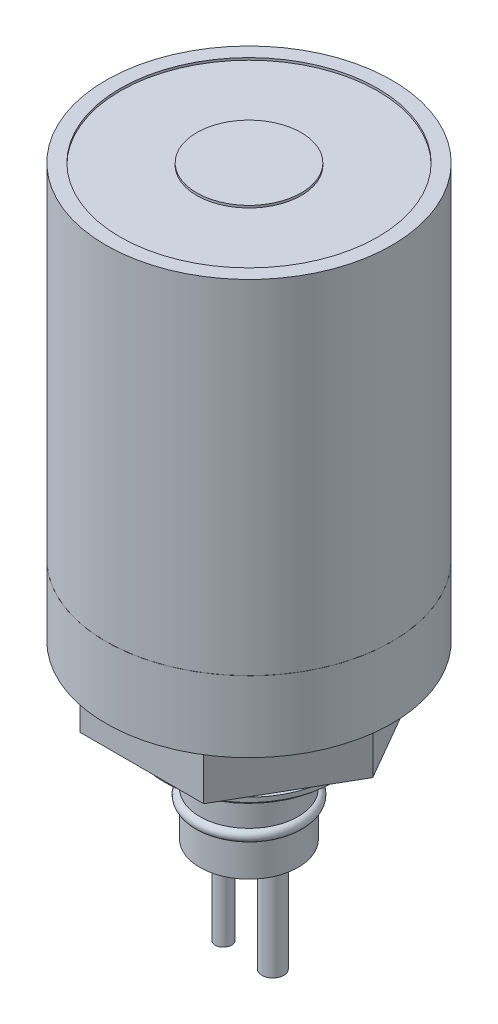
ISO-10303-21;
HEADER;
FILE_DESCRIPTION(('STEP AP214'),'2;1');
FILE_NAME('part.step','',(''),(''),'','','');
FILE_SCHEMA(('AUTOMOTIVE_DESIGN { 1 0 10303 214 1 1 1 1 }'));
ENDSEC;
DATA;
#1=APPLICATION_CONTEXT('core data for automotive mechanical design processes');
#2=APPLICATION_PROTOCOL_DEFINITION('international standard','automotive_design',2000,#1);
#3=PRODUCT_CONTEXT('',#1,'mechanical');
#4=PRODUCT('Part','Part','',(#3));
#5=PRODUCT_RELATED_PRODUCT_CATEGORY('part','',(#4));
#6=PRODUCT_DEFINITION_FORMATION('','',#4);
#7=PRODUCT_DEFINITION_CONTEXT('part definition',#1,'design');
#8=PRODUCT_DEFINITION('design','',#6,#7);
#9=PRODUCT_DEFINITION_SHAPE('','',#8);
#10=(LENGTH_UNIT() NAMED_UNIT(*) SI_UNIT(.MILLI.,.METRE.));
#11=(NAMED_UNIT(*) PLANE_ANGLE_UNIT() SI_UNIT($,.RADIAN.));
#12=(NAMED_UNIT(*) SI_UNIT($,.STERADIAN.) SOLID_ANGLE_UNIT());
#13=UNCERTAINTY_MEASURE_WITH_UNIT(LENGTH_MEASURE(1.E-05),#10,'distance_accuracy_value','');
#14=(GEOMETRIC_REPRESENTATION_CONTEXT(3) GLOBAL_UNCERTAINTY_ASSIGNED_CONTEXT((#13)) GLOBAL_UNIT_ASSIGNED_CONTEXT((#10,
#11,#12)) REPRESENTATION_CONTEXT('',''));
#15=CARTESIAN_POINT('',(0.,0.,0.));
#16=DIRECTION('',(0.,0.,1.));
#17=DIRECTION('',(1.,0.,0.));
#18=AXIS2_PLACEMENT_3D('',#15,#16,#17);
#19=CARTESIAN_POINT('',(5.4536748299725,-65.0367,0.));
#20=DIRECTION('',(0.,1.,0.));
#21=DIRECTION('',(-1.,0.,0.));
#22=AXIS2_PLACEMENT_3D('',#19,#20,#21);
#23=PLANE('',#22);
#24=CARTESIAN_POINT('',(-2.84049327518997,-65.0367,0.));
#25=DIRECTION('',(0.,1.,0.));
#26=DIRECTION('',(-1.,0.,0.));
#27=AXIS2_PLACEMENT_3D('',#24,#25,#26);
#28=CIRCLE('',#27,0.905408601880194);
#29=CARTESIAN_POINT('',(-3.74590187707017,-65.0367,0.));
#30=VERTEX_POINT('',#29);
#31=EDGE_CURVE('E56',#30,#30,#28,.F.);
#32=ORIENTED_EDGE('',*,*,#31,.F.);
#33=EDGE_LOOP('',(#32));
#34=FACE_BOUND('',#33,.T.);
#35=CARTESIAN_POINT('',(0.,-65.0367,0.));
#36=DIRECTION('',(0.,1.,0.));
#37=DIRECTION('',(-1.,0.,0.));
#38=AXIS2_PLACEMENT_3D('',#35,#36,#37);
#39=CIRCLE('',#38,5.45367482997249);
#40=CARTESIAN_POINT('',(-5.45367482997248,-65.0367,0.));
#41=VERTEX_POINT('',#40);
#42=EDGE_CURVE('E137',#41,#41,#39,.T.);
#43=ORIENTED_EDGE('',*,*,#42,.F.);
#44=EDGE_LOOP('',(#43));
#45=FACE_BOUND('',#44,.T.);
#46=CARTESIAN_POINT('',(2.64776545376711,-65.0367,0.));
#47=DIRECTION('',(0.,1.,0.));
#48=DIRECTION('',(-1.,0.,0.));
#49=AXIS2_PLACEMENT_3D('',#46,#47,#48);
#50=CIRCLE('',#49,1.21312683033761);
#51=CARTESIAN_POINT('',(1.4346386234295,-65.0367,0.));
#52=VERTEX_POINT('',#51);
#53=EDGE_CURVE('E12',#52,#52,#50,.F.);
#54=ORIENTED_EDGE('',*,*,#53,.F.);
#55=EDGE_LOOP('',(#54));
#56=FACE_BOUND('',#55,.T.);
#57=ADVANCED_FACE('F48',(#34,#45,#56),#23,.F.);
#58=CARTESIAN_POINT('',(0.,-52.2514068,0.));
#59=DIRECTION('',(0.,-1.,0.));
#60=DIRECTION('',(0.,0.,-1.));
#61=AXIS2_PLACEMENT_3D('',#58,#59,#60);
#62=PLANE('',#61);
#63=DIRECTION('',(0.5,0.,0.866025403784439));
#64=VECTOR('',#63,1.);
#65=CARTESIAN_POINT('',(6.87041046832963,-52.2514068,-11.8999));
#66=LINE('',#65,#64);
#67=CARTESIAN_POINT('',(6.87041046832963,-52.2514068,-11.8999));
#68=VERTEX_POINT('',#67);
#69=CARTESIAN_POINT('',(13.7408209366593,-52.2514068,0.));
#70=VERTEX_POINT('',#69);
#71=EDGE_CURVE('E145',#68,#70,#66,.T.);
#72=ORIENTED_EDGE('',*,*,#71,.T.);
#73=DIRECTION('',(-0.5,0.,0.866025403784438));
#74=VECTOR('',#73,1.);
#75=CARTESIAN_POINT('',(13.7408209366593,-52.2514068,0.));
#76=LINE('',#75,#74);
#77=CARTESIAN_POINT('',(6.87041046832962,-52.2514068,11.8999));
#78=VERTEX_POINT('',#77);
#79=EDGE_CURVE('E99',#70,#78,#76,.T.);
#80=ORIENTED_EDGE('',*,*,#79,.T.);
#81=DIRECTION('',(-1.,0.,0.));
#82=VECTOR('',#81,1.);
#83=CARTESIAN_POINT('',(6.87041046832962,-52.2514068,11.8999));
#84=LINE('',#83,#82);
#85=CARTESIAN_POINT('',(-6.87041046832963,-52.2514068,11.8999));
#86=VERTEX_POINT('',#85);
#87=EDGE_CURVE('E113',#78,#86,#84,.T.);
#88=ORIENTED_EDGE('',*,*,#87,.T.);
#89=DIRECTION('',(-0.5,0.,-0.866025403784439));
#90=VECTOR('',#89,1.);
#91=CARTESIAN_POINT('',(-6.87041046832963,-52.2514068,11.8999));
#92=LINE('',#91,#90);
#93=CARTESIAN_POINT('',(-13.7408209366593,-52.2514068,0.));
#94=VERTEX_POINT('',#93);
#95=EDGE_CURVE('E106',#86,#94,#92,.T.);
#96=ORIENTED_EDGE('',*,*,#95,.T.);
#97=DIRECTION('',(0.5,0.,-0.866025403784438));
#98=VECTOR('',#97,1.);
#99=CARTESIAN_POINT('',(-13.7408209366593,-52.2514068,0.));
#100=LINE('',#99,#98);
#101=CARTESIAN_POINT('',(-6.87041046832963,-52.2514068,-11.8999));
#102=VERTEX_POINT('',#101);
#103=EDGE_CURVE('E111',#94,#102,#100,.T.);
#104=ORIENTED_EDGE('',*,*,#103,.T.);
#105=DIRECTION('',(1.,0.,0.));
#106=VECTOR('',#105,1.);
#107=CARTESIAN_POINT('',(-6.87041046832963,-52.2514068,-11.8999));
#108=LINE('',#107,#106);
#109=EDGE_CURVE('E71',#102,#68,#108,.T.);
#110=ORIENTED_EDGE('',*,*,#109,.T.);
#111=EDGE_LOOP('',(#72,#80,#88,#96,#104,#110));
#112=FACE_BOUND('',#111,.T.);
#113=CARTESIAN_POINT('',(0.,-52.2514068,0.));
#114=DIRECTION('',(0.,1.,0.));
#115=DIRECTION('',(-1.,0.,0.));
#116=AXIS2_PLACEMENT_3D('',#113,#114,#115);
#117=CIRCLE('',#116,8.801);
#118=CARTESIAN_POINT('',(-8.80099999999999,-52.2514068,0.));
#119=VERTEX_POINT('',#118);
#120=EDGE_CURVE('E385',#119,#119,#117,.T.);
#121=ORIENTED_EDGE('',*,*,#120,.T.);
#122=EDGE_LOOP('',(#121));
#123=FACE_BOUND('',#122,.T.);
#124=ADVANCED_FACE('F108',(#112,#123),#62,.T.);
#125=CARTESIAN_POINT('',(0.,-45.9867,0.));
#126=DIRECTION('',(0.,-1.,0.));
#127=DIRECTION('',(0.,0.,-1.));
#128=AXIS2_PLACEMENT_3D('',#125,#126,#127);
#129=PLANE('',#128);
#130=CARTESIAN_POINT('',(0.,-45.9867,0.));
#131=DIRECTION('',(0.,-1.,0.));
#132=DIRECTION('',(0.,0.,-1.));
#133=AXIS2_PLACEMENT_3D('',#130,#131,#132);
#134=CIRCLE('',#133,15.875);
#135=CARTESIAN_POINT('',(0.,-45.9867,-15.875));
#136=VERTEX_POINT('',#135);
#137=EDGE_CURVE('E175',#136,#136,#134,.T.);
#138=ORIENTED_EDGE('',*,*,#137,.T.);
#139=EDGE_LOOP('',(#138));
#140=FACE_BOUND('',#139,.T.);
#141=CARTESIAN_POINT('',(11.6859302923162,-45.9867,-6.74687500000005));
#142=DIRECTION('',(0.,-1.,0.));
#143=DIRECTION('',(0.,0.,-1.));
#144=AXIS2_PLACEMENT_3D('',#141,#142,#143);
#145=CIRCLE('',#144,1.35255);
#146=CARTESIAN_POINT('',(11.6859302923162,-45.9867,-8.09942500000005));
#147=VERTEX_POINT('',#146);
#148=EDGE_CURVE('E168',#147,#147,#145,.T.);
#149=ORIENTED_EDGE('',*,*,#148,.F.);
#150=EDGE_LOOP('',(#149));
#151=FACE_BOUND('',#150,.T.);
#152=CARTESIAN_POINT('',(-11.6859302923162,-45.9867,-6.74687500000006));
#153=DIRECTION('',(0.,-1.,0.));
#154=DIRECTION('',(0.,0.,-1.));
#155=AXIS2_PLACEMENT_3D('',#152,#153,#154);
#156=CIRCLE('',#155,1.35255);
#157=CARTESIAN_POINT('',(-11.6859302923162,-45.9867,-8.09942500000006));
#158=VERTEX_POINT('',#157);
#159=EDGE_CURVE('E164',#158,#158,#156,.T.);
#160=ORIENTED_EDGE('',*,*,#159,.F.);
#161=EDGE_LOOP('',(#160));
#162=FACE_BOUND('',#161,.T.);
#163=CARTESIAN_POINT('',(0.,-45.9867,13.49375));
#164=DIRECTION('',(0.,-1.,0.));
#165=DIRECTION('',(0.,0.,-1.));
#166=AXIS2_PLACEMENT_3D('',#163,#164,#165);
#167=CIRCLE('',#166,1.35255);
#168=CARTESIAN_POINT('',(0.,-45.9867,12.1412));
#169=VERTEX_POINT('',#168);
#170=EDGE_CURVE('E160',#169,#169,#167,.T.);
#171=ORIENTED_EDGE('',*,*,#170,.F.);
#172=EDGE_LOOP('',(#171));
#173=FACE_BOUND('',#172,.T.);
#174=DIRECTION('',(-0.5,0.,0.866025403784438));
#175=VECTOR('',#174,1.);
#176=CARTESIAN_POINT('',(13.7408209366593,-45.9867,0.));
#177=LINE('',#176,#175);
#178=CARTESIAN_POINT('',(13.7408209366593,-45.9867,0.));
#179=VERTEX_POINT('',#178);
#180=CARTESIAN_POINT('',(6.87041046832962,-45.9867,11.8999));
#181=VERTEX_POINT('',#180);
#182=EDGE_CURVE('E136',#179,#181,#177,.T.);
#183=ORIENTED_EDGE('',*,*,#182,.F.);
#184=DIRECTION('',(0.5,0.,0.866025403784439));
#185=VECTOR('',#184,1.);
#186=CARTESIAN_POINT('',(6.87041046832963,-45.9867,-11.8999));
#187=LINE('',#186,#185);
#188=CARTESIAN_POINT('',(6.87041046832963,-45.9867,-11.8999));
#189=VERTEX_POINT('',#188);
#190=EDGE_CURVE('E133',#189,#179,#187,.T.);
#191=ORIENTED_EDGE('',*,*,#190,.F.);
#192=DIRECTION('',(1.,0.,0.));
#193=VECTOR('',#192,1.);
#194=CARTESIAN_POINT('',(-6.87041046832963,-45.9867,-11.8999));
#195=LINE('',#194,#193);
#196=CARTESIAN_POINT('',(-6.87041046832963,-45.9867,-11.8999));
#197=VERTEX_POINT('',#196);
#198=EDGE_CURVE('E91',#197,#189,#195,.T.);
#199=ORIENTED_EDGE('',*,*,#198,.F.);
#200=DIRECTION('',(0.5,0.,-0.866025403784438));
#201=VECTOR('',#200,1.);
#202=CARTESIAN_POINT('',(-13.7408209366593,-45.9867,0.));
#203=LINE('',#202,#201);
#204=CARTESIAN_POINT('',(-13.7408209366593,-45.9867,0.));
#205=VERTEX_POINT('',#204);
#206=EDGE_CURVE('E142',#205,#197,#203,.T.);
#207=ORIENTED_EDGE('',*,*,#206,.F.);
#208=DIRECTION('',(-0.5,0.,-0.866025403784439));
#209=VECTOR('',#208,1.);
#210=CARTESIAN_POINT('',(-6.87041046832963,-45.9867,11.8999));
#211=LINE('',#210,#209);
#212=CARTESIAN_POINT('',(-6.87041046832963,-45.9867,11.8999));
#213=VERTEX_POINT('',#212);
#214=EDGE_CURVE('E122',#213,#205,#211,.T.);
#215=ORIENTED_EDGE('',*,*,#214,.F.);
#216=DIRECTION('',(-1.,0.,0.));
#217=VECTOR('',#216,1.);
#218=CARTESIAN_POINT('',(6.87041046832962,-45.9867,11.8999));
#219=LINE('',#218,#217);
#220=EDGE_CURVE('E139',#181,#213,#219,.T.);
#221=ORIENTED_EDGE('',*,*,#220,.F.);
#222=EDGE_LOOP('',(#183,#191,#199,#207,#215,#221));
#223=FACE_BOUND('',#222,.T.);
#224=ADVANCED_FACE('F270',(#140,#151,#162,#173,#223),#129,.T.);
#225=CARTESIAN_POINT('',(0.,-45.9867,0.));
#226=DIRECTION('',(0.,1.,0.));
#227=DIRECTION('',(0.,0.,1.));
#228=AXIS2_PLACEMENT_3D('',#225,#226,#227);
#229=CYLINDRICAL_SURFACE('',#228,15.875);
#230=ORIENTED_EDGE('',*,*,#137,.F.);
#231=EDGE_LOOP('',(#230));
#232=FACE_BOUND('',#231,.T.);
#233=CARTESIAN_POINT('',(0.,-38.1127,0.));
#234=DIRECTION('',(0.,-1.,0.));
#235=DIRECTION('',(0.,0.,-1.));
#236=AXIS2_PLACEMENT_3D('',#233,#234,#235);
#237=CIRCLE('',#236,15.875);
#238=CARTESIAN_POINT('',(0.,-38.1127,-15.875));
#239=VERTEX_POINT('',#238);
#240=EDGE_CURVE('E174',#239,#239,#237,.T.);
#241=ORIENTED_EDGE('',*,*,#240,.T.);
#242=EDGE_LOOP('',(#241));
#243=FACE_BOUND('',#242,.T.);
#244=ADVANCED_FACE('F50',(#232,#243),#229,.T.);
#245=CARTESIAN_POINT('',(0.,-38.1127,0.));
#246=DIRECTION('',(0.,-1.,0.));
#247=DIRECTION('',(0.,0.,-1.));
#248=AXIS2_PLACEMENT_3D('',#245,#246,#247);
#249=PLANE('',#248);
#250=CARTESIAN_POINT('',(-0.140879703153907,-38.1127,0.0854933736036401));
#251=DIRECTION('',(0.,-1.,0.));
#252=DIRECTION('',(0.,0.,-1.));
#253=AXIS2_PLACEMENT_3D('',#250,#251,#252);
#254=CIRCLE('',#253,4.96062);
#255=CARTESIAN_POINT('',(-0.140879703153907,-38.1127,-4.87512662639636));
#256=VERTEX_POINT('',#255);
#257=EDGE_CURVE('E157',#256,#256,#254,.T.);
#258=ORIENTED_EDGE('',*,*,#257,.T.);
#259=EDGE_LOOP('',(#258));
#260=FACE_BOUND('',#259,.T.);
#261=CARTESIAN_POINT('',(0.,-38.1127,13.49375));
#262=DIRECTION('',(0.,-1.,0.));
#263=DIRECTION('',(0.,0.,-1.));
#264=AXIS2_PLACEMENT_3D('',#261,#262,#263);
#265=CIRCLE('',#264,1.35255);
#266=CARTESIAN_POINT('',(0.,-38.1127,12.1412));
#267=VERTEX_POINT('',#266);
#268=EDGE_CURVE('E163',#267,#267,#265,.T.);
#269=ORIENTED_EDGE('',*,*,#268,.T.);
#270=EDGE_LOOP('',(#269));
#271=FACE_BOUND('',#270,.T.);
#272=CARTESIAN_POINT('',(-11.6859302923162,-38.1127,-6.74687500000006));
#273=DIRECTION('',(0.,-1.,0.));
#274=DIRECTION('',(0.,0.,-1.));
#275=AXIS2_PLACEMENT_3D('',#272,#273,#274);
#276=CIRCLE('',#275,1.35255);
#277=CARTESIAN_POINT('',(-11.6859302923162,-38.1127,-8.09942500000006));
#278=VERTEX_POINT('',#277);
#279=EDGE_CURVE('E167',#278,#278,#276,.T.);
#280=ORIENTED_EDGE('',*,*,#279,.T.);
#281=EDGE_LOOP('',(#280));
#282=FACE_BOUND('',#281,.T.);
#283=CARTESIAN_POINT('',(11.6859302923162,-38.1127,-6.74687500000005));
#284=DIRECTION('',(0.,-1.,0.));
#285=DIRECTION('',(0.,0.,-1.));
#286=AXIS2_PLACEMENT_3D('',#283,#284,#285);
#287=CIRCLE('',#286,1.35255);
#288=CARTESIAN_POINT('',(11.6859302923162,-38.1127,-8.09942500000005));
#289=VERTEX_POINT('',#288);
#290=EDGE_CURVE('E171',#289,#289,#287,.T.);
#291=ORIENTED_EDGE('',*,*,#290,.T.);
#292=EDGE_LOOP('',(#291));
#293=FACE_BOUND('',#292,.T.);
#294=ORIENTED_EDGE('',*,*,#240,.F.);
#295=EDGE_LOOP('',(#294));
#296=FACE_BOUND('',#295,.T.);
#297=ADVANCED_FACE('F307',(#260,#271,#282,#293,#296),#249,.F.);
#298=CARTESIAN_POINT('',(11.6859302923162,-45.9867,-6.74687500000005));
#299=DIRECTION('',(0.,-1.,0.));
#300=DIRECTION('',(0.,0.,-1.));
#301=AXIS2_PLACEMENT_3D('',#298,#299,#300);
#302=CYLINDRICAL_SURFACE('',#301,1.35255);
#303=ORIENTED_EDGE('',*,*,#148,.T.);
#304=EDGE_LOOP('',(#303));
#305=FACE_BOUND('',#304,.T.);
#306=ORIENTED_EDGE('',*,*,#290,.F.);
#307=EDGE_LOOP('',(#306));
#308=FACE_BOUND('',#307,.T.);
#309=ADVANCED_FACE('F303',(#305,#308),#302,.F.);
#310=CARTESIAN_POINT('',(-11.6859302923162,-45.9867,-6.74687500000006));
#311=DIRECTION('',(0.,-1.,0.));
#312=DIRECTION('',(0.,0.,-1.));
#313=AXIS2_PLACEMENT_3D('',#310,#311,#312);
#314=CYLINDRICAL_SURFACE('',#313,1.35255);
#315=ORIENTED_EDGE('',*,*,#159,.T.);
#316=EDGE_LOOP('',(#315));
#317=FACE_BOUND('',#316,.T.);
#318=ORIENTED_EDGE('',*,*,#279,.F.);
#319=EDGE_LOOP('',(#318));
#320=FACE_BOUND('',#319,.T.);
#321=ADVANCED_FACE('F299',(#317,#320),#314,.F.);
#322=CARTESIAN_POINT('',(0.,-45.9867,13.49375));
#323=DIRECTION('',(0.,-1.,0.));
#324=DIRECTION('',(0.,0.,-1.));
#325=AXIS2_PLACEMENT_3D('',#322,#323,#324);
#326=CYLINDRICAL_SURFACE('',#325,1.35255);
#327=ORIENTED_EDGE('',*,*,#170,.T.);
#328=EDGE_LOOP('',(#327));
#329=FACE_BOUND('',#328,.T.);
#330=ORIENTED_EDGE('',*,*,#268,.F.);
#331=EDGE_LOOP('',(#330));
#332=FACE_BOUND('',#331,.T.);
#333=ADVANCED_FACE('F295',(#329,#332),#326,.F.);
#334=CARTESIAN_POINT('',(-0.140879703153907,-45.9867,0.0854933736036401));
#335=DIRECTION('',(0.,-1.,0.));
#336=DIRECTION('',(0.,0.,-1.));
#337=AXIS2_PLACEMENT_3D('',#334,#335,#336);
#338=CYLINDRICAL_SURFACE('',#337,4.96062);
#339=CARTESIAN_POINT('',(-0.140879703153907,-45.9867,0.0854933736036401));
#340=DIRECTION('',(0.,-1.,0.));
#341=DIRECTION('',(0.,0.,-1.));
#342=AXIS2_PLACEMENT_3D('',#339,#340,#341);
#343=CIRCLE('',#342,4.96062);
#344=CARTESIAN_POINT('',(-0.140879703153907,-45.9867,-4.87512662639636));
#345=VERTEX_POINT('',#344);
#346=EDGE_CURVE('E154',#345,#345,#343,.F.);
#347=ORIENTED_EDGE('',*,*,#346,.F.);
#348=EDGE_LOOP('',(#347));
#349=FACE_BOUND('',#348,.T.);
#350=ORIENTED_EDGE('',*,*,#257,.F.);
#351=EDGE_LOOP('',(#350));
#352=FACE_BOUND('',#351,.T.);
#353=ADVANCED_FACE('F275',(#349,#352),#338,.F.);
#354=CARTESIAN_POINT('',(0.,-45.9867,0.));
#355=DIRECTION('',(0.,-1.,0.));
#356=DIRECTION('',(0.,0.,-1.));
#357=AXIS2_PLACEMENT_3D('',#354,#355,#356);
#358=PLANE('',#357);
#359=ORIENTED_EDGE('',*,*,#346,.T.);
#360=EDGE_LOOP('',(#359));
#361=FACE_BOUND('',#360,.T.);
#362=ADVANCED_FACE('F271',(#361),#358,.F.);
#363=CARTESIAN_POINT('',(6.87041046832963,-52.2514068,-11.8999));
#364=DIRECTION('',(-0.866025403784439,0.,0.5));
#365=DIRECTION('',(0.5,0.,0.866025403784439));
#366=AXIS2_PLACEMENT_3D('',#363,#364,#365);
#367=PLANE('',#366);
#368=ORIENTED_EDGE('',*,*,#190,.T.);
#369=DIRECTION('',(0.,1.,0.));
#370=VECTOR('',#369,1.);
#371=CARTESIAN_POINT('',(13.7408209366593,-52.2514068,0.));
#372=LINE('',#371,#370);
#373=EDGE_CURVE('E152',#70,#179,#372,.T.);
#374=ORIENTED_EDGE('',*,*,#373,.F.);
#375=ORIENTED_EDGE('',*,*,#71,.F.);
#376=DIRECTION('',(0.,1.,0.));
#377=VECTOR('',#376,1.);
#378=CARTESIAN_POINT('',(6.87041046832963,-52.2514068,-11.8999));
#379=LINE('',#378,#377);
#380=EDGE_CURVE('E129',#68,#189,#379,.T.);
#381=ORIENTED_EDGE('',*,*,#380,.T.);
#382=EDGE_LOOP('',(#368,#374,#375,#381));
#383=FACE_BOUND('',#382,.T.);
#384=ADVANCED_FACE('F274',(#383),#367,.F.);
#385=CARTESIAN_POINT('',(13.7408209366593,-52.2514068,0.));
#386=DIRECTION('',(-0.866025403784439,0.,-0.5));
#387=DIRECTION('',(-0.5,0.,0.866025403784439));
#388=AXIS2_PLACEMENT_3D('',#385,#386,#387);
#389=PLANE('',#388);
#390=ORIENTED_EDGE('',*,*,#182,.T.);
#391=DIRECTION('',(0.,1.,0.));
#392=VECTOR('',#391,1.);
#393=CARTESIAN_POINT('',(6.87041046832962,-52.2514068,11.8999));
#394=LINE('',#393,#392);
#395=EDGE_CURVE('E149',#78,#181,#394,.T.);
#396=ORIENTED_EDGE('',*,*,#395,.F.);
#397=ORIENTED_EDGE('',*,*,#79,.F.);
#398=ORIENTED_EDGE('',*,*,#373,.T.);
#399=EDGE_LOOP('',(#390,#396,#397,#398));
#400=FACE_BOUND('',#399,.T.);
#401=ADVANCED_FACE('F286',(#400),#389,.F.);
#402=CARTESIAN_POINT('',(6.87041046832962,-52.2514068,11.8999));
#403=DIRECTION('',(0.,0.,-1.));
#404=DIRECTION('',(-1.,0.,0.));
#405=AXIS2_PLACEMENT_3D('',#402,#403,#404);
#406=PLANE('',#405);
#407=ORIENTED_EDGE('',*,*,#220,.T.);
#408=DIRECTION('',(0.,1.,0.));
#409=VECTOR('',#408,1.);
#410=CARTESIAN_POINT('',(-6.87041046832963,-52.2514068,11.8999));
#411=LINE('',#410,#409);
#412=EDGE_CURVE('E125',#86,#213,#411,.T.);
#413=ORIENTED_EDGE('',*,*,#412,.F.);
#414=ORIENTED_EDGE('',*,*,#87,.F.);
#415=ORIENTED_EDGE('',*,*,#395,.T.);
#416=EDGE_LOOP('',(#407,#413,#414,#415));
#417=FACE_BOUND('',#416,.T.);
#418=ADVANCED_FACE('F283',(#417),#406,.F.);
#419=CARTESIAN_POINT('',(-6.87041046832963,-52.2514068,11.8999));
#420=DIRECTION('',(0.866025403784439,0.,-0.5));
#421=DIRECTION('',(-0.5,0.,-0.866025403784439));
#422=AXIS2_PLACEMENT_3D('',#419,#420,#421);
#423=PLANE('',#422);
#424=ORIENTED_EDGE('',*,*,#214,.T.);
#425=DIRECTION('',(0.,1.,0.));
#426=VECTOR('',#425,1.);
#427=CARTESIAN_POINT('',(-13.7408209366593,-52.2514068,0.));
#428=LINE('',#427,#426);
#429=EDGE_CURVE('E119',#94,#205,#428,.T.);
#430=ORIENTED_EDGE('',*,*,#429,.F.);
#431=ORIENTED_EDGE('',*,*,#95,.F.);
#432=ORIENTED_EDGE('',*,*,#412,.T.);
#433=EDGE_LOOP('',(#424,#430,#431,#432));
#434=FACE_BOUND('',#433,.T.);
#435=ADVANCED_FACE('F120',(#434),#423,.F.);
#436=CARTESIAN_POINT('',(-13.7408209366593,-52.2514068,0.));
#437=DIRECTION('',(0.866025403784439,0.,0.5));
#438=DIRECTION('',(0.5,0.,-0.866025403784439));
#439=AXIS2_PLACEMENT_3D('',#436,#437,#438);
#440=PLANE('',#439);
#441=ORIENTED_EDGE('',*,*,#206,.T.);
#442=DIRECTION('',(0.,1.,0.));
#443=VECTOR('',#442,1.);
#444=CARTESIAN_POINT('',(-6.87041046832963,-52.2514068,-11.8999));
#445=LINE('',#444,#443);
#446=EDGE_CURVE('E63',#102,#197,#445,.T.);
#447=ORIENTED_EDGE('',*,*,#446,.F.);
#448=ORIENTED_EDGE('',*,*,#103,.F.);
#449=ORIENTED_EDGE('',*,*,#429,.T.);
#450=EDGE_LOOP('',(#441,#447,#448,#449));
#451=FACE_BOUND('',#450,.T.);
#452=ADVANCED_FACE('F127',(#451),#440,.F.);
#453=CARTESIAN_POINT('',(-6.87041046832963,-52.2514068,-11.8999));
#454=DIRECTION('',(0.,0.,1.));
#455=DIRECTION('',(1.,0.,0.));
#456=AXIS2_PLACEMENT_3D('',#453,#454,#455);
#457=PLANE('',#456);
#458=ORIENTED_EDGE('',*,*,#198,.T.);
#459=ORIENTED_EDGE('',*,*,#380,.F.);
#460=ORIENTED_EDGE('',*,*,#109,.F.);
#461=ORIENTED_EDGE('',*,*,#446,.T.);
#462=EDGE_LOOP('',(#458,#459,#460,#461));
#463=FACE_BOUND('',#462,.T.);
#464=ADVANCED_FACE('F265',(#463),#457,.F.);
#465=CARTESIAN_POINT('',(0.,0.,0.));
#466=DIRECTION('',(0.,1.,0.));
#467=DIRECTION('',(-1.,0.,0.));
#468=AXIS2_PLACEMENT_3D('',#465,#466,#467);
#469=CYLINDRICAL_SURFACE('',#468,5.45367482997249);
#470=CARTESIAN_POINT('',(0.,-61.3286105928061,0.));
#471=DIRECTION('',(0.,1.,0.));
#472=DIRECTION('',(-1.,0.,0.));
#473=AXIS2_PLACEMENT_3D('',#470,#471,#472);
#474=CIRCLE('',#473,5.45367482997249);
#475=CARTESIAN_POINT('',(-5.45367482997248,-61.3286105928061,0.));
#476=VERTEX_POINT('',#475);
#477=EDGE_CURVE('E349',#476,#476,#474,.T.);
#478=ORIENTED_EDGE('',*,*,#477,.F.);
#479=EDGE_LOOP('',(#478));
#480=FACE_BOUND('',#479,.T.);
#481=ORIENTED_EDGE('',*,*,#42,.T.);
#482=EDGE_LOOP('',(#481));
#483=FACE_BOUND('',#482,.T.);
#484=ADVANCED_FACE('F262',(#480,#483),#469,.T.);
#485=CARTESIAN_POINT('',(0.,-60.7396378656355,0.));
#486=DIRECTION('',(0.,1.,0.));
#487=DIRECTION('',(-1.,0.,0.));
#488=AXIS2_PLACEMENT_3D('',#485,#486,#487);
#489=TOROIDAL_SURFACE('',#488,5.45367482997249,0.588972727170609);
#490=CARTESIAN_POINT('',(0.,-60.1506651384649,0.));
#491=DIRECTION('',(0.,1.,0.));
#492=DIRECTION('',(-1.,0.,0.));
#493=AXIS2_PLACEMENT_3D('',#490,#491,#492);
#494=CIRCLE('',#493,5.45367482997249);
#495=CARTESIAN_POINT('',(-5.45367482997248,-60.1506651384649,0.));
#496=VERTEX_POINT('',#495);
#497=EDGE_CURVE('E352',#496,#496,#494,.T.);
#498=ORIENTED_EDGE('',*,*,#497,.F.);
#499=EDGE_LOOP('',(#498));
#500=FACE_BOUND('',#499,.T.);
#501=ORIENTED_EDGE('',*,*,#477,.T.);
#502=EDGE_LOOP('',(#501));
#503=FACE_BOUND('',#502,.T.);
#504=ADVANCED_FACE('F258',(#500,#503),#489,.T.);
#505=CARTESIAN_POINT('',(0.,0.,0.));
#506=DIRECTION('',(0.,1.,0.));
#507=DIRECTION('',(-1.,0.,0.));
#508=AXIS2_PLACEMENT_3D('',#505,#506,#507);
#509=CYLINDRICAL_SURFACE('',#508,5.45367482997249);
#510=CARTESIAN_POINT('',(0.,-55.3809408,0.));
#511=DIRECTION('',(0.,1.,0.));
#512=DIRECTION('',(-1.,0.,0.));
#513=AXIS2_PLACEMENT_3D('',#510,#511,#512);
#514=CIRCLE('',#513,5.45367482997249);
#515=CARTESIAN_POINT('',(-5.45367482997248,-55.3809408,0.));
#516=VERTEX_POINT('',#515);
#517=EDGE_CURVE('E355',#516,#516,#514,.T.);
#518=ORIENTED_EDGE('',*,*,#517,.F.);
#519=EDGE_LOOP('',(#518));
#520=FACE_BOUND('',#519,.T.);
#521=ORIENTED_EDGE('',*,*,#497,.T.);
#522=EDGE_LOOP('',(#521));
#523=FACE_BOUND('',#522,.T.);
#524=ADVANCED_FACE('F254',(#520,#523),#509,.T.);
#525=CARTESIAN_POINT('',(8.80100000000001,-55.3809408,0.));
#526=DIRECTION('',(0.,1.,0.));
#527=DIRECTION('',(-1.,0.,0.));
#528=AXIS2_PLACEMENT_3D('',#525,#526,#527);
#529=PLANE('',#528);
#530=CARTESIAN_POINT('',(0.,-55.3809408,0.));
#531=DIRECTION('',(0.,1.,0.));
#532=DIRECTION('',(-1.,0.,0.));
#533=AXIS2_PLACEMENT_3D('',#530,#531,#532);
#534=CIRCLE('',#533,8.801);
#535=CARTESIAN_POINT('',(-8.80099999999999,-55.3809408,0.));
#536=VERTEX_POINT('',#535);
#537=EDGE_CURVE('E358',#536,#536,#534,.T.);
#538=ORIENTED_EDGE('',*,*,#537,.F.);
#539=EDGE_LOOP('',(#538));
#540=FACE_BOUND('',#539,.T.);
#541=ORIENTED_EDGE('',*,*,#517,.T.);
#542=EDGE_LOOP('',(#541));
#543=FACE_BOUND('',#542,.T.);
#544=ADVANCED_FACE('F250',(#540,#543),#529,.F.);
#545=CARTESIAN_POINT('',(0.,0.,0.));
#546=DIRECTION('',(0.,1.,0.));
#547=DIRECTION('',(-1.,0.,0.));
#548=AXIS2_PLACEMENT_3D('',#545,#546,#547);
#549=CYLINDRICAL_SURFACE('',#548,8.801);
#550=CARTESIAN_POINT('',(0.,-54.8729408,0.));
#551=DIRECTION('',(0.,1.,0.));
#552=DIRECTION('',(-1.,0.,0.));
#553=AXIS2_PLACEMENT_3D('',#550,#551,#552);
#554=CIRCLE('',#553,8.801);
#555=CARTESIAN_POINT('',(-8.80099999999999,-54.8729408,0.));
#556=VERTEX_POINT('',#555);
#557=EDGE_CURVE('E361',#556,#556,#554,.T.);
#558=ORIENTED_EDGE('',*,*,#557,.F.);
#559=EDGE_LOOP('',(#558));
#560=FACE_BOUND('',#559,.T.);
#561=ORIENTED_EDGE('',*,*,#537,.T.);
#562=EDGE_LOOP('',(#561));
#563=FACE_BOUND('',#562,.T.);
#564=ADVANCED_FACE('F246',(#560,#563),#549,.T.);
#565=CARTESIAN_POINT('',(9.39800000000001,-54.8729408,0.));
#566=DIRECTION('',(0.,1.,0.));
#567=DIRECTION('',(-1.,0.,0.));
#568=AXIS2_PLACEMENT_3D('',#565,#566,#567);
#569=PLANE('',#568);
#570=CARTESIAN_POINT('',(0.,-54.8729408,0.));
#571=DIRECTION('',(0.,1.,0.));
#572=DIRECTION('',(-1.,0.,0.));
#573=AXIS2_PLACEMENT_3D('',#570,#571,#572);
#574=CIRCLE('',#573,9.398);
#575=CARTESIAN_POINT('',(-9.39799999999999,-54.8729408,0.));
#576=VERTEX_POINT('',#575);
#577=EDGE_CURVE('E364',#576,#576,#574,.T.);
#578=ORIENTED_EDGE('',*,*,#577,.F.);
#579=EDGE_LOOP('',(#578));
#580=FACE_BOUND('',#579,.T.);
#581=ORIENTED_EDGE('',*,*,#557,.T.);
#582=EDGE_LOOP('',(#581));
#583=FACE_BOUND('',#582,.T.);
#584=ADVANCED_FACE('F242',(#580,#583),#569,.F.);
#585=CARTESIAN_POINT('',(0.,0.,0.));
#586=DIRECTION('',(0.,1.,0.));
#587=DIRECTION('',(-1.,0.,0.));
#588=AXIS2_PLACEMENT_3D('',#585,#586,#587);
#589=CYLINDRICAL_SURFACE('',#588,9.398);
#590=CARTESIAN_POINT('',(0.,-54.3649408,0.));
#591=DIRECTION('',(0.,1.,0.));
#592=DIRECTION('',(-1.,0.,0.));
#593=AXIS2_PLACEMENT_3D('',#590,#591,#592);
#594=CIRCLE('',#593,9.398);
#595=CARTESIAN_POINT('',(-9.39799999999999,-54.3649408,0.));
#596=VERTEX_POINT('',#595);
#597=EDGE_CURVE('E367',#596,#596,#594,.T.);
#598=ORIENTED_EDGE('',*,*,#597,.F.);
#599=EDGE_LOOP('',(#598));
#600=FACE_BOUND('',#599,.T.);
#601=ORIENTED_EDGE('',*,*,#577,.T.);
#602=EDGE_LOOP('',(#601));
#603=FACE_BOUND('',#602,.T.);
#604=ADVANCED_FACE('F238',(#600,#603),#589,.T.);
#605=CARTESIAN_POINT('',(8.801,-54.3649408,0.));
#606=DIRECTION('',(0.,-1.,0.));
#607=DIRECTION('',(1.,0.,0.));
#608=AXIS2_PLACEMENT_3D('',#605,#606,#607);
#609=PLANE('',#608);
#610=CARTESIAN_POINT('',(0.,-54.3649408,0.));
#611=DIRECTION('',(0.,1.,0.));
#612=DIRECTION('',(-1.,0.,0.));
#613=AXIS2_PLACEMENT_3D('',#610,#611,#612);
#614=CIRCLE('',#613,8.80099999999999);
#615=CARTESIAN_POINT('',(-8.80099999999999,-54.3649408,0.));
#616=VERTEX_POINT('',#615);
#617=EDGE_CURVE('E370',#616,#616,#614,.T.);
#618=ORIENTED_EDGE('',*,*,#617,.F.);
#619=EDGE_LOOP('',(#618));
#620=FACE_BOUND('',#619,.T.);
#621=ORIENTED_EDGE('',*,*,#597,.T.);
#622=EDGE_LOOP('',(#621));
#623=FACE_BOUND('',#622,.T.);
#624=ADVANCED_FACE('F234',(#620,#623),#609,.F.);
#625=CARTESIAN_POINT('',(0.,0.,0.));
#626=DIRECTION('',(0.,1.,0.));
#627=DIRECTION('',(-1.,0.,0.));
#628=AXIS2_PLACEMENT_3D('',#625,#626,#627);
#629=CYLINDRICAL_SURFACE('',#628,8.801);
#630=CARTESIAN_POINT('',(0.,-53.8569408,0.));
#631=DIRECTION('',(0.,1.,0.));
#632=DIRECTION('',(-1.,0.,0.));
#633=AXIS2_PLACEMENT_3D('',#630,#631,#632);
#634=CIRCLE('',#633,8.801);
#635=CARTESIAN_POINT('',(-8.80099999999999,-53.8569408,0.));
#636=VERTEX_POINT('',#635);
#637=EDGE_CURVE('E373',#636,#636,#634,.T.);
#638=ORIENTED_EDGE('',*,*,#637,.F.);
#639=EDGE_LOOP('',(#638));
#640=FACE_BOUND('',#639,.T.);
#641=ORIENTED_EDGE('',*,*,#617,.T.);
#642=EDGE_LOOP('',(#641));
#643=FACE_BOUND('',#642,.T.);
#644=ADVANCED_FACE('F230',(#640,#643),#629,.T.);
#645=CARTESIAN_POINT('',(9.39800000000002,-53.8569408,0.));
#646=DIRECTION('',(0.,1.,0.));
#647=DIRECTION('',(-1.,0.,0.));
#648=AXIS2_PLACEMENT_3D('',#645,#646,#647);
#649=PLANE('',#648);
#650=CARTESIAN_POINT('',(0.,-53.8569408,0.));
#651=DIRECTION('',(0.,1.,0.));
#652=DIRECTION('',(-1.,0.,0.));
#653=AXIS2_PLACEMENT_3D('',#650,#651,#652);
#654=CIRCLE('',#653,9.39800000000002);
#655=CARTESIAN_POINT('',(-9.39800000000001,-53.8569408,0.));
#656=VERTEX_POINT('',#655);
#657=EDGE_CURVE('E376',#656,#656,#654,.T.);
#658=ORIENTED_EDGE('',*,*,#657,.F.);
#659=EDGE_LOOP('',(#658));
#660=FACE_BOUND('',#659,.T.);
#661=ORIENTED_EDGE('',*,*,#637,.T.);
#662=EDGE_LOOP('',(#661));
#663=FACE_BOUND('',#662,.T.);
#664=ADVANCED_FACE('F226',(#660,#663),#649,.F.);
#665=CARTESIAN_POINT('',(0.,0.,0.));
#666=DIRECTION('',(0.,1.,0.));
#667=DIRECTION('',(-1.,0.,0.));
#668=AXIS2_PLACEMENT_3D('',#665,#666,#667);
#669=CYLINDRICAL_SURFACE('',#668,9.39800000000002);
#670=CARTESIAN_POINT('',(0.,-53.3489408,0.));
#671=DIRECTION('',(0.,1.,0.));
#672=DIRECTION('',(-1.,0.,0.));
#673=AXIS2_PLACEMENT_3D('',#670,#671,#672);
#674=CIRCLE('',#673,9.39800000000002);
#675=CARTESIAN_POINT('',(-9.39800000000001,-53.3489408,0.));
#676=VERTEX_POINT('',#675);
#677=EDGE_CURVE('E379',#676,#676,#674,.T.);
#678=ORIENTED_EDGE('',*,*,#677,.F.);
#679=EDGE_LOOP('',(#678));
#680=FACE_BOUND('',#679,.T.);
#681=ORIENTED_EDGE('',*,*,#657,.T.);
#682=EDGE_LOOP('',(#681));
#683=FACE_BOUND('',#682,.T.);
#684=ADVANCED_FACE('F222',(#680,#683),#669,.T.);
#685=CARTESIAN_POINT('',(8.80100000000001,-53.3489408,0.));
#686=DIRECTION('',(0.,-1.,0.));
#687=DIRECTION('',(1.,0.,0.));
#688=AXIS2_PLACEMENT_3D('',#685,#686,#687);
#689=PLANE('',#688);
#690=CARTESIAN_POINT('',(0.,-53.3489408,0.));
#691=DIRECTION('',(0.,1.,0.));
#692=DIRECTION('',(-1.,0.,0.));
#693=AXIS2_PLACEMENT_3D('',#690,#691,#692);
#694=CIRCLE('',#693,8.801);
#695=CARTESIAN_POINT('',(-8.80099999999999,-53.3489408,0.));
#696=VERTEX_POINT('',#695);
#697=EDGE_CURVE('E382',#696,#696,#694,.T.);
#698=ORIENTED_EDGE('',*,*,#697,.F.);
#699=EDGE_LOOP('',(#698));
#700=FACE_BOUND('',#699,.T.);
#701=ORIENTED_EDGE('',*,*,#677,.T.);
#702=EDGE_LOOP('',(#701));
#703=FACE_BOUND('',#702,.T.);
#704=ADVANCED_FACE('F218',(#700,#703),#689,.F.);
#705=CARTESIAN_POINT('',(0.,0.,0.));
#706=DIRECTION('',(0.,1.,0.));
#707=DIRECTION('',(-1.,0.,0.));
#708=AXIS2_PLACEMENT_3D('',#705,#706,#707);
#709=CYLINDRICAL_SURFACE('',#708,8.801);
#710=ORIENTED_EDGE('',*,*,#120,.F.);
#711=EDGE_LOOP('',(#710));
#712=FACE_BOUND('',#711,.T.);
#713=ORIENTED_EDGE('',*,*,#697,.T.);
#714=EDGE_LOOP('',(#713));
#715=FACE_BOUND('',#714,.T.);
#716=ADVANCED_FACE('F214',(#712,#715),#709,.T.);
#717=CARTESIAN_POINT('',(-2.84049327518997,-76.2127,0.));
#718=DIRECTION('',(0.,1.,0.));
#719=DIRECTION('',(-1.,0.,0.));
#720=AXIS2_PLACEMENT_3D('',#717,#718,#719);
#721=CYLINDRICAL_SURFACE('',#720,0.905408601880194);
#722=CARTESIAN_POINT('',(-2.84049327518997,-76.2127,0.));
#723=DIRECTION('',(0.,-1.,0.));
#724=DIRECTION('',(1.,0.,0.));
#725=AXIS2_PLACEMENT_3D('',#722,#723,#724);
#726=CIRCLE('',#725,0.905408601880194);
#727=CARTESIAN_POINT('',(-1.93508467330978,-76.2127,0.));
#728=VERTEX_POINT('',#727);
#729=EDGE_CURVE('E388',#728,#728,#726,.T.);
#730=ORIENTED_EDGE('',*,*,#729,.F.);
#731=EDGE_LOOP('',(#730));
#732=FACE_BOUND('',#731,.T.);
#733=ORIENTED_EDGE('',*,*,#31,.T.);
#734=EDGE_LOOP('',(#733));
#735=FACE_BOUND('',#734,.T.);
#736=ADVANCED_FACE('F186',(#732,#735),#721,.T.);
#737=CARTESIAN_POINT('',(-2.84049327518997,-76.2127,0.));
#738=DIRECTION('',(0.,-1.,0.));
#739=DIRECTION('',(1.,0.,0.));
#740=AXIS2_PLACEMENT_3D('',#737,#738,#739);
#741=PLANE('',#740);
#742=ORIENTED_EDGE('',*,*,#729,.T.);
#743=EDGE_LOOP('',(#742));
#744=FACE_BOUND('',#743,.T.);
#745=ADVANCED_FACE('F199',(#744),#741,.T.);
#746=CARTESIAN_POINT('',(2.64776545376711,-76.2127,0.));
#747=DIRECTION('',(0.,1.,0.));
#748=DIRECTION('',(-1.,0.,0.));
#749=AXIS2_PLACEMENT_3D('',#746,#747,#748);
#750=CYLINDRICAL_SURFACE('',#749,1.21312683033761);
#751=CARTESIAN_POINT('',(2.64776545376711,-76.2127,0.));
#752=DIRECTION('',(0.,-1.,0.));
#753=DIRECTION('',(1.,0.,0.));
#754=AXIS2_PLACEMENT_3D('',#751,#752,#753);
#755=CIRCLE('',#754,1.21312683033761);
#756=CARTESIAN_POINT('',(3.86089228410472,-76.2127,0.));
#757=VERTEX_POINT('',#756);
#758=EDGE_CURVE('E391',#757,#757,#755,.T.);
#759=ORIENTED_EDGE('',*,*,#758,.F.);
#760=EDGE_LOOP('',(#759));
#761=FACE_BOUND('',#760,.T.);
#762=ORIENTED_EDGE('',*,*,#53,.T.);
#763=EDGE_LOOP('',(#762));
#764=FACE_BOUND('',#763,.T.);
#765=ADVANCED_FACE('F196',(#761,#764),#750,.T.);
#766=CARTESIAN_POINT('',(2.64776545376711,-76.2127,0.));
#767=DIRECTION('',(0.,-1.,0.));
#768=DIRECTION('',(1.,0.,0.));
#769=AXIS2_PLACEMENT_3D('',#766,#767,#768);
#770=PLANE('',#769);
#771=ORIENTED_EDGE('',*,*,#758,.T.);
#772=EDGE_LOOP('',(#771));
#773=FACE_BOUND('',#772,.T.);
#774=ADVANCED_FACE('F198',(#773),#770,.T.);
#775=CLOSED_SHELL('',(#57,#124,#224,#244,#297,#309,#321,#333,#353,#362,#384,#401,#418,#435,#452,
#464,#484,#504,#524,#544,#564,#584,#604,#624,#644,#664,#684,#704,#716,#736,#745,#765,#774));
#776=MANIFOLD_SOLID_BREP('B2',#775);
#777=CARTESIAN_POINT('',(0.,-38.1,0.));
#778=DIRECTION('',(0.,1.,0.));
#779=DIRECTION('',(0.,0.,1.));
#780=AXIS2_PLACEMENT_3D('',#777,#778,#779);
#781=CYLINDRICAL_SURFACE('',#780,15.875);
#782=CARTESIAN_POINT('',(0.,-38.1,0.));
#783=DIRECTION('',(0.,1.,0.));
#784=DIRECTION('',(0.,0.,1.));
#785=AXIS2_PLACEMENT_3D('',#782,#783,#784);
#786=CIRCLE('',#785,15.875);
#787=CARTESIAN_POINT('',(0.,-38.1,15.875));
#788=VERTEX_POINT('',#787);
#789=EDGE_CURVE('E46',#788,#788,#786,.T.);
#790=ORIENTED_EDGE('',*,*,#789,.T.);
#791=EDGE_LOOP('',(#790));
#792=FACE_BOUND('',#791,.T.);
#793=CARTESIAN_POINT('',(0.,0.,0.));
#794=DIRECTION('',(0.,1.,0.));
#795=DIRECTION('',(0.,0.,1.));
#796=AXIS2_PLACEMENT_3D('',#793,#794,#795);
#797=CIRCLE('',#796,15.875);
#798=CARTESIAN_POINT('',(0.,0.,15.875));
#799=VERTEX_POINT('',#798);
#800=EDGE_CURVE('E632',#799,#799,#797,.T.);
#801=ORIENTED_EDGE('',*,*,#800,.F.);
#802=EDGE_LOOP('',(#801));
#803=FACE_BOUND('',#802,.T.);
#804=ADVANCED_FACE('F624',(#792,#803),#781,.T.);
#805=CARTESIAN_POINT('',(0.,-38.1,0.));
#806=DIRECTION('',(0.,1.,0.));
#807=DIRECTION('',(0.,0.,1.));
#808=AXIS2_PLACEMENT_3D('',#805,#806,#807);
#809=PLANE('',#808);
#810=CARTESIAN_POINT('',(-0.140879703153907,-38.1,0.0854933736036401));
#811=DIRECTION('',(0.,1.,0.));
#812=DIRECTION('',(0.,0.,1.));
#813=AXIS2_PLACEMENT_3D('',#810,#811,#812);
#814=CIRCLE('',#813,4.96062);
#815=CARTESIAN_POINT('',(-0.140879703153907,-38.1,5.04611337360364));
#816=VERTEX_POINT('',#815);
#817=EDGE_CURVE('E627',#816,#816,#814,.T.);
#818=ORIENTED_EDGE('',*,*,#817,.T.);
#819=EDGE_LOOP('',(#818));
#820=FACE_BOUND('',#819,.T.);
#821=CARTESIAN_POINT('',(0.,-38.1,13.49375));
#822=DIRECTION('',(0.,1.,0.));
#823=DIRECTION('',(0.,0.,1.));
#824=AXIS2_PLACEMENT_3D('',#821,#822,#823);
#825=CIRCLE('',#824,1.35255);
#826=CARTESIAN_POINT('',(0.,-38.1,14.8463));
#827=VERTEX_POINT('',#826);
#828=EDGE_CURVE('E661',#827,#827,#825,.T.);
#829=ORIENTED_EDGE('',*,*,#828,.T.);
#830=EDGE_LOOP('',(#829));
#831=FACE_BOUND('',#830,.T.);
#832=CARTESIAN_POINT('',(-11.6859302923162,-38.1,-6.74687500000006));
#833=DIRECTION('',(0.,1.,0.));
#834=DIRECTION('',(0.,0.,1.));
#835=AXIS2_PLACEMENT_3D('',#832,#833,#834);
#836=CIRCLE('',#835,1.35255);
#837=CARTESIAN_POINT('',(-11.6859302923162,-38.1,-5.39432500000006));
#838=VERTEX_POINT('',#837);
#839=EDGE_CURVE('E665',#838,#838,#836,.T.);
#840=ORIENTED_EDGE('',*,*,#839,.T.);
#841=EDGE_LOOP('',(#840));
#842=FACE_BOUND('',#841,.T.);
#843=CARTESIAN_POINT('',(11.6859302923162,-38.1,-6.74687500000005));
#844=DIRECTION('',(0.,1.,0.));
#845=DIRECTION('',(0.,0.,1.));
#846=AXIS2_PLACEMENT_3D('',#843,#844,#845);
#847=CIRCLE('',#846,1.35255);
#848=CARTESIAN_POINT('',(11.6859302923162,-38.1,-5.39432500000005));
#849=VERTEX_POINT('',#848);
#850=EDGE_CURVE('E669',#849,#849,#847,.T.);
#851=ORIENTED_EDGE('',*,*,#850,.T.);
#852=EDGE_LOOP('',(#851));
#853=FACE_BOUND('',#852,.T.);
#854=ORIENTED_EDGE('',*,*,#789,.F.);
#855=EDGE_LOOP('',(#854));
#856=FACE_BOUND('',#855,.T.);
#857=ADVANCED_FACE('F690',(#820,#831,#842,#853,#856),#809,.F.);
#858=CARTESIAN_POINT('',(0.,0.,0.));
#859=DIRECTION('',(0.,1.,0.));
#860=DIRECTION('',(0.,0.,1.));
#861=AXIS2_PLACEMENT_3D('',#858,#859,#860);
#862=PLANE('',#861);
#863=CARTESIAN_POINT('',(0.,0.,0.));
#864=DIRECTION('',(0.,1.,0.));
#865=DIRECTION('',(0.,0.,1.));
#866=AXIS2_PLACEMENT_3D('',#863,#864,#865);
#867=CIRCLE('',#866,14.3002);
#868=CARTESIAN_POINT('',(0.,0.,14.3002));
#869=VERTEX_POINT('',#868);
#870=EDGE_CURVE('E673',#869,#869,#867,.T.);
#871=ORIENTED_EDGE('',*,*,#870,.F.);
#872=EDGE_LOOP('',(#871));
#873=FACE_BOUND('',#872,.T.);
#874=ORIENTED_EDGE('',*,*,#800,.T.);
#875=EDGE_LOOP('',(#874));
#876=FACE_BOUND('',#875,.T.);
#877=ADVANCED_FACE('F713',(#873,#876),#862,.T.);
#878=CARTESIAN_POINT('',(0.,-0.254,0.));
#879=DIRECTION('',(0.,1.,0.));
#880=DIRECTION('',(0.,0.,1.));
#881=AXIS2_PLACEMENT_3D('',#878,#879,#880);
#882=CYLINDRICAL_SURFACE('',#881,14.3002);
#883=CARTESIAN_POINT('',(0.,-0.254,0.));
#884=DIRECTION('',(0.,1.,0.));
#885=DIRECTION('',(0.,0.,1.));
#886=AXIS2_PLACEMENT_3D('',#883,#884,#885);
#887=CIRCLE('',#886,14.3002);
#888=CARTESIAN_POINT('',(0.,-0.254,14.3002));
#889=VERTEX_POINT('',#888);
#890=EDGE_CURVE('E677',#889,#889,#887,.T.);
#891=ORIENTED_EDGE('',*,*,#890,.F.);
#892=EDGE_LOOP('',(#891));
#893=FACE_BOUND('',#892,.T.);
#894=ORIENTED_EDGE('',*,*,#870,.T.);
#895=EDGE_LOOP('',(#894));
#896=FACE_BOUND('',#895,.T.);
#897=ADVANCED_FACE('F721',(#893,#896),#882,.F.);
#898=CARTESIAN_POINT('',(0.,-0.254,0.));
#899=DIRECTION('',(0.,1.,0.));
#900=DIRECTION('',(0.,0.,1.));
#901=AXIS2_PLACEMENT_3D('',#898,#899,#900);
#902=PLANE('',#901);
#903=CARTESIAN_POINT('',(0.,-0.254,0.));
#904=DIRECTION('',(0.,1.,0.));
#905=DIRECTION('',(0.,0.,1.));
#906=AXIS2_PLACEMENT_3D('',#903,#904,#905);
#907=CIRCLE('',#906,5.80058094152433);
#908=CARTESIAN_POINT('',(0.,-0.254,5.80058094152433));
#909=VERTEX_POINT('',#908);
#910=EDGE_CURVE('E670',#909,#909,#907,.T.);
#911=ORIENTED_EDGE('',*,*,#910,.F.);
#912=EDGE_LOOP('',(#911));
#913=FACE_BOUND('',#912,.T.);
#914=ORIENTED_EDGE('',*,*,#890,.T.);
#915=EDGE_LOOP('',(#914));
#916=FACE_BOUND('',#915,.T.);
#917=ADVANCED_FACE('F727',(#913,#916),#902,.T.);
#918=CARTESIAN_POINT('',(0.,-0.254,0.));
#919=DIRECTION('',(0.,1.,0.));
#920=DIRECTION('',(0.,0.,1.));
#921=AXIS2_PLACEMENT_3D('',#918,#919,#920);
#922=CYLINDRICAL_SURFACE('',#921,5.80058094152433);
#923=ORIENTED_EDGE('',*,*,#910,.T.);
#924=EDGE_LOOP('',(#923));
#925=FACE_BOUND('',#924,.T.);
#926=CARTESIAN_POINT('',(0.,0.,0.));
#927=DIRECTION('',(0.,1.,0.));
#928=DIRECTION('',(0.,0.,1.));
#929=AXIS2_PLACEMENT_3D('',#926,#927,#928);
#930=CIRCLE('',#929,5.80058094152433);
#931=CARTESIAN_POINT('',(0.,0.,5.80058094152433));
#932=VERTEX_POINT('',#931);
#933=EDGE_CURVE('E674',#932,#932,#930,.T.);
#934=ORIENTED_EDGE('',*,*,#933,.F.);
#935=EDGE_LOOP('',(#934));
#936=FACE_BOUND('',#935,.T.);
#937=ADVANCED_FACE('F733',(#925,#936),#922,.T.);
#938=ORIENTED_EDGE('',*,*,#933,.T.);
#939=EDGE_LOOP('',(#938));
#940=FACE_BOUND('',#939,.T.);
#941=ADVANCED_FACE('F723',(#940),#862,.T.);
#942=CARTESIAN_POINT('',(11.6859302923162,-45.9867,-6.74687500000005));
#943=DIRECTION('',(0.,-1.,0.));
#944=DIRECTION('',(0.,0.,-1.));
#945=AXIS2_PLACEMENT_3D('',#942,#943,#944);
#946=CYLINDRICAL_SURFACE('',#945,1.35255);
#947=CARTESIAN_POINT('',(11.6859302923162,-36.5887,-6.74687500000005));
#948=DIRECTION('',(0.,-1.,0.));
#949=DIRECTION('',(0.,0.,-1.));
#950=AXIS2_PLACEMENT_3D('',#947,#948,#949);
#951=CIRCLE('',#950,1.35255);
#952=CARTESIAN_POINT('',(11.6859302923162,-36.5887,-8.09942500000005));
#953=VERTEX_POINT('',#952);
#954=EDGE_CURVE('E666',#953,#953,#951,.T.);
#955=ORIENTED_EDGE('',*,*,#954,.F.);
#956=EDGE_LOOP('',(#955));
#957=FACE_BOUND('',#956,.T.);
#958=ORIENTED_EDGE('',*,*,#850,.F.);
#959=EDGE_LOOP('',(#958));
#960=FACE_BOUND('',#959,.T.);
#961=ADVANCED_FACE('F732',(#957,#960),#946,.F.);
#962=CARTESIAN_POINT('',(11.6859302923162,-36.5887,-6.74687500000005));
#963=DIRECTION('',(0.,-1.,0.));
#964=DIRECTION('',(0.,0.,-1.));
#965=AXIS2_PLACEMENT_3D('',#962,#963,#964);
#966=CONICAL_SURFACE('',#965,1.35255,1.02974425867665);
#967=CARTESIAN_POINT('',(11.6859302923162,-35.7760059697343,-6.74687500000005));
#968=VERTEX_POINT('',#967);
#969=VERTEX_LOOP('',#968);
#970=FACE_BOUND('',#969,.T.);
#971=ORIENTED_EDGE('',*,*,#954,.T.);
#972=EDGE_LOOP('',(#971));
#973=FACE_BOUND('',#972,.T.);
#974=ADVANCED_FACE('F739',(#970,#973),#966,.F.);
#975=CARTESIAN_POINT('',(-11.6859302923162,-45.9867,-6.74687500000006));
#976=DIRECTION('',(0.,-1.,0.));
#977=DIRECTION('',(0.,0.,-1.));
#978=AXIS2_PLACEMENT_3D('',#975,#976,#977);
#979=CYLINDRICAL_SURFACE('',#978,1.35255);
#980=CARTESIAN_POINT('',(-11.6859302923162,-36.5887,-6.74687500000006));
#981=DIRECTION('',(0.,-1.,0.));
#982=DIRECTION('',(0.,0.,-1.));
#983=AXIS2_PLACEMENT_3D('',#980,#981,#982);
#984=CIRCLE('',#983,1.35255);
#985=CARTESIAN_POINT('',(-11.6859302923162,-36.5887,-8.09942500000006));
#986=VERTEX_POINT('',#985);
#987=EDGE_CURVE('E662',#986,#986,#984,.T.);
#988=ORIENTED_EDGE('',*,*,#987,.F.);
#989=EDGE_LOOP('',(#988));
#990=FACE_BOUND('',#989,.T.);
#991=ORIENTED_EDGE('',*,*,#839,.F.);
#992=EDGE_LOOP('',(#991));
#993=FACE_BOUND('',#992,.T.);
#994=ADVANCED_FACE('F705',(#990,#993),#979,.F.);
#995=CARTESIAN_POINT('',(-11.6859302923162,-36.5887,-6.74687500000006));
#996=DIRECTION('',(0.,-1.,0.));
#997=DIRECTION('',(0.,0.,-1.));
#998=AXIS2_PLACEMENT_3D('',#995,#996,#997);
#999=CONICAL_SURFACE('',#998,1.35255,1.02974425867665);
#1000=CARTESIAN_POINT('',(-11.6859302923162,-35.7760059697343,-6.74687500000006));
#1001=VERTEX_POINT('',#1000);
#1002=VERTEX_LOOP('',#1001);
#1003=FACE_BOUND('',#1002,.T.);
#1004=ORIENTED_EDGE('',*,*,#987,.T.);
#1005=EDGE_LOOP('',(#1004));
#1006=FACE_BOUND('',#1005,.T.);
#1007=ADVANCED_FACE('F696',(#1003,#1006),#999,.F.);
#1008=CARTESIAN_POINT('',(0.,-45.9867,13.49375));
#1009=DIRECTION('',(0.,-1.,0.));
#1010=DIRECTION('',(0.,0.,-1.));
#1011=AXIS2_PLACEMENT_3D('',#1008,#1009,#1010);
#1012=CYLINDRICAL_SURFACE('',#1011,1.35255);
#1013=CARTESIAN_POINT('',(0.,-36.5887,13.49375));
#1014=DIRECTION('',(0.,-1.,0.));
#1015=DIRECTION('',(0.,0.,-1.));
#1016=AXIS2_PLACEMENT_3D('',#1013,#1014,#1015);
#1017=CIRCLE('',#1016,1.35255);
#1018=CARTESIAN_POINT('',(0.,-36.5887,12.1412));
#1019=VERTEX_POINT('',#1018);
#1020=EDGE_CURVE('E657',#1019,#1019,#1017,.T.);
#1021=ORIENTED_EDGE('',*,*,#1020,.F.);
#1022=EDGE_LOOP('',(#1021));
#1023=FACE_BOUND('',#1022,.T.);
#1024=ORIENTED_EDGE('',*,*,#828,.F.);
#1025=EDGE_LOOP('',(#1024));
#1026=FACE_BOUND('',#1025,.T.);
#1027=ADVANCED_FACE('F693',(#1023,#1026),#1012,.F.);
#1028=CARTESIAN_POINT('',(0.,-36.5887,13.49375));
#1029=DIRECTION('',(0.,-1.,0.));
#1030=DIRECTION('',(0.,0.,-1.));
#1031=AXIS2_PLACEMENT_3D('',#1028,#1029,#1030);
#1032=CONICAL_SURFACE('',#1031,1.35255,1.02974425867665);
#1033=CARTESIAN_POINT('',(0.,-35.7760059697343,13.49375));
#1034=VERTEX_POINT('',#1033);
#1035=VERTEX_LOOP('',#1034);
#1036=FACE_BOUND('',#1035,.T.);
#1037=ORIENTED_EDGE('',*,*,#1020,.T.);
#1038=EDGE_LOOP('',(#1037));
#1039=FACE_BOUND('',#1038,.T.);
#1040=ADVANCED_FACE('F695',(#1036,#1039),#1032,.F.);
#1041=CARTESIAN_POINT('',(-0.140879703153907,-45.9867,0.0854933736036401));
#1042=DIRECTION('',(0.,-1.,0.));
#1043=DIRECTION('',(0.,0.,-1.));
#1044=AXIS2_PLACEMENT_3D('',#1041,#1042,#1043);
#1045=CYLINDRICAL_SURFACE('',#1044,4.96062);
#1046=CARTESIAN_POINT('',(-0.140879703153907,-35.5219,0.0854933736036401));
#1047=DIRECTION('',(0.,-1.,0.));
#1048=DIRECTION('',(0.,0.,-1.));
#1049=AXIS2_PLACEMENT_3D('',#1046,#1047,#1048);
#1050=CIRCLE('',#1049,4.96062);
#1051=CARTESIAN_POINT('',(-0.140879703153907,-35.5219,-4.87512662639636));
#1052=VERTEX_POINT('',#1051);
#1053=EDGE_CURVE('E653',#1052,#1052,#1050,.T.);
#1054=ORIENTED_EDGE('',*,*,#1053,.F.);
#1055=EDGE_LOOP('',(#1054));
#1056=FACE_BOUND('',#1055,.T.);
#1057=ORIENTED_EDGE('',*,*,#817,.F.);
#1058=EDGE_LOOP('',(#1057));
#1059=FACE_BOUND('',#1058,.T.);
#1060=ADVANCED_FACE('F649',(#1056,#1059),#1045,.F.);
#1061=CARTESIAN_POINT('',(-0.140879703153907,-35.5219,0.0854933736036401));
#1062=DIRECTION('',(0.,-1.,0.));
#1063=DIRECTION('',(0.,0.,-1.));
#1064=AXIS2_PLACEMENT_3D('',#1061,#1062,#1063);
#1065=CONICAL_SURFACE('',#1064,4.96062,1.02974425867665);
#1066=CARTESIAN_POINT('',(-0.14087970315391,-32.5412587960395,0.0854933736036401));
#1067=VERTEX_POINT('',#1066);
#1068=VERTEX_LOOP('',#1067);
#1069=FACE_BOUND('',#1068,.T.);
#1070=ORIENTED_EDGE('',*,*,#1053,.T.);
#1071=EDGE_LOOP('',(#1070));
#1072=FACE_BOUND('',#1071,.T.);
#1073=ADVANCED_FACE('F646',(#1069,#1072),#1065,.F.);
#1074=CLOSED_SHELL('',(#804,#857,#877,#897,#917,#937,#941,#961,#974,#994,#1007,#1027,#1040,
#1060,#1073));
#1075=MANIFOLD_SOLID_BREP('B6',#1074);
#1076=ADVANCED_BREP_SHAPE_REPRESENTATION('',(#18,#776,#1075),#14);
#1077=SHAPE_DEFINITION_REPRESENTATION(#9,#1076);
ENDSEC;
END-ISO-10303-21;
